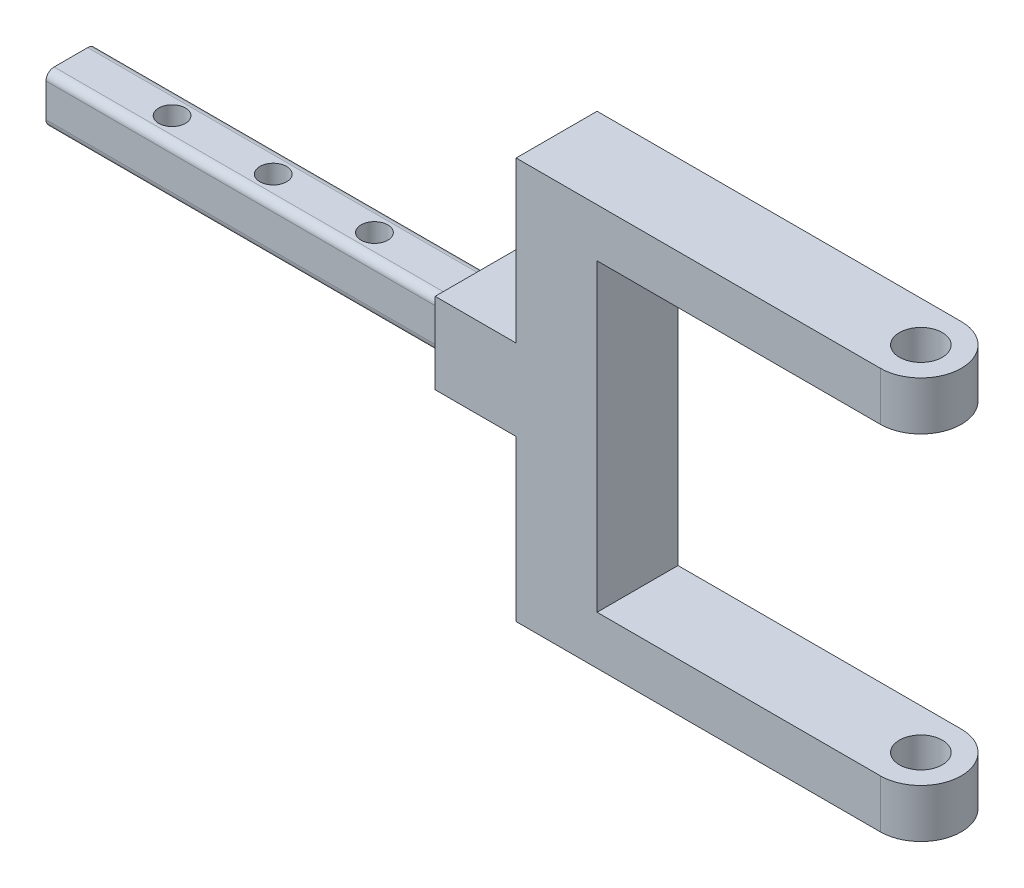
from build123d import *

# Parameters (mm, degrees)
EXTRUDE_1_DEPTH     = 10
SKETCH_2_W          = 10
SKETCH_2_H          = 10
SKETCH_2_W_2        = 6.15
SKETCH_2_H_2        = 6.15
EXTRUDE_2_DEPTH     = 10
EXTRUDE_START       = 10
SKETCH_2_3_W        = 6.15
SKETCH_2_3_H        = 6.15
EXTRUDE_3_DEPTH     = 50
CUT_EXTRUDE_1_DEPTH = 87.372217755
SKETCH_4_R          = 1.65
CUT_EXTRUDE_2_DEPTH = 77.00668145
FILLET_1_R          = 1


with BuildPart() as part:
    # Sketch 1 → Extrude 1 (new body)
    with BuildSketch(Plane.XY):
        Polygon((0, 18.8), (0, -18.8), (40, -18.8), (40, -24.8), (-10, -24.8), (-10, 24.8), (40, 24.8), (40, 18.8), align=None)
    extrude(amount=EXTRUDE_1_DEPTH)

    # Sketch 2 → Extrude 2 (add)
    # profile 1 of 2: a face of its own
    with BuildSketch(Plane.ZY.offset(10)):
        with Locations((5, 0)):
            Rectangle(SKETCH_2_W, SKETCH_2_H)
        with Locations((5, 0)):
            Rectangle(SKETCH_2_W_2, SKETCH_2_H_2, mode=Mode.SUBTRACT)
    # profile 2 of 2: a face of its own
    with BuildSketch(Plane.ZY.offset(10)):
        with Locations((5, 0)):
            Rectangle(SKETCH_2_W_2, SKETCH_2_H_2)
    extrude(amount=EXTRUDE_2_DEPTH)

    # Sketch 2_3 → Extrude 3 (add)
    with BuildSketch(Plane.ZY.offset(10).offset(EXTRUDE_START)):
        with Locations((5, 0)):
            Rectangle(SKETCH_2_3_W, SKETCH_2_3_H)
    extrude(amount=EXTRUDE_3_DEPTH)

    # Sketch 3 → Cut-Extrude 1 (cut, through all)
    with BuildSketch(Plane(origin=(0, 24.8, 0), x_dir=(1, 0, 0), z_dir=(0, 1, 0))):
        with BuildLine():
            ThreePointArc((32.35, -5), (35, -7.65), (37.65, -5))
            Line((37.65, -5), (32.35, -5))
        make_face()
        with BuildLine():
            Line((32.35, -5), (37.65, -5))
            ThreePointArc((37.65, -5), (35, -2.35), (32.35, -5))
        make_face()
        with BuildLine():
            ThreePointArc((32.35, -5), (35, -7.65), (37.65, -5))
            Line((37.65, -5), (32.35, -5))
        make_face()
        with BuildLine():
            Line((32.35, -5), (37.65, -5))
            ThreePointArc((37.65, -5), (35, -2.35), (32.35, -5))
        make_face()
        with BuildLine():
            ThreePointArc((35, 0), (38.535533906, -1.464466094), (40, -5))
            Line((40, -5), (40, 0))
            Line((40, 0), (35, 0))
        make_face()
        with BuildLine():
            Line((40, -10), (40, -5))
            ThreePointArc((40, -5), (38.535533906, -8.535533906), (35, -10))
            Line((35, -10), (40, -10))
        make_face()
    extrude(amount=-CUT_EXTRUDE_1_DEPTH, mode=Mode.SUBTRACT)

    # Sketch 4 → Cut-Extrude 2 (cut, through all)
    with BuildSketch(Plane(origin=(0, 3.075, 0), x_dir=(1, 0, 0), z_dir=(0, 1, 0))):
        with Locations(Location((-45, -5, 0), (0, 0, 180))):
            Circle(SKETCH_4_R)
        with Locations(Location((-32.5, -5, 0), (0, 0, 180))):
            Circle(SKETCH_4_R)
        with Locations(Location((-57.5, -5, 0), (0, 0, 180))):
            Circle(SKETCH_4_R)
    extrude(amount=-CUT_EXTRUDE_2_DEPTH, mode=Mode.SUBTRACT)

    # Fillet 1
    fillet_1_edges = [part.edges().sort_by_distance(p)[0] for p in [
        (-45, -3.075, 1.925),
        (-45, -3.075, 8.075),
        (-45, 3.075, 8.075),
        (-45, 3.075, 1.925),
    ]]
    fillet(fillet_1_edges, radius=FILLET_1_R)


solid = part.part
